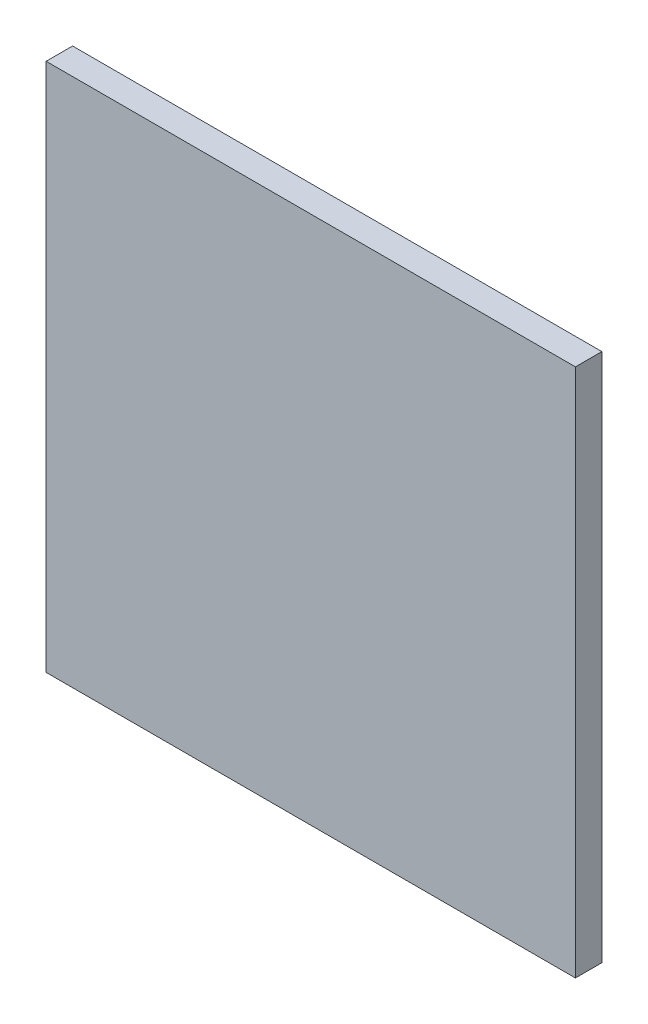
ISO-10303-21;
HEADER;
FILE_DESCRIPTION(('STEP AP214'),'2;1');
FILE_NAME('part.step','',(''),(''),'','','');
FILE_SCHEMA(('AUTOMOTIVE_DESIGN { 1 0 10303 214 1 1 1 1 }'));
ENDSEC;
DATA;
#1=APPLICATION_CONTEXT('core data for automotive mechanical design processes');
#2=APPLICATION_PROTOCOL_DEFINITION('international standard','automotive_design',2000,#1);
#3=PRODUCT_CONTEXT('',#1,'mechanical');
#4=PRODUCT('Part','Part','',(#3));
#5=PRODUCT_RELATED_PRODUCT_CATEGORY('part','',(#4));
#6=PRODUCT_DEFINITION_FORMATION('','',#4);
#7=PRODUCT_DEFINITION_CONTEXT('part definition',#1,'design');
#8=PRODUCT_DEFINITION('design','',#6,#7);
#9=PRODUCT_DEFINITION_SHAPE('','',#8);
#10=(LENGTH_UNIT() NAMED_UNIT(*) SI_UNIT(.MILLI.,.METRE.));
#11=(NAMED_UNIT(*) PLANE_ANGLE_UNIT() SI_UNIT($,.RADIAN.));
#12=(NAMED_UNIT(*) SI_UNIT($,.STERADIAN.) SOLID_ANGLE_UNIT());
#13=UNCERTAINTY_MEASURE_WITH_UNIT(LENGTH_MEASURE(1.E-05),#10,'distance_accuracy_value','');
#14=(GEOMETRIC_REPRESENTATION_CONTEXT(3) GLOBAL_UNCERTAINTY_ASSIGNED_CONTEXT((#13)) GLOBAL_UNIT_ASSIGNED_CONTEXT((#10,
#11,#12)) REPRESENTATION_CONTEXT('',''));
#15=CARTESIAN_POINT('',(0.,0.,0.));
#16=DIRECTION('',(0.,0.,1.));
#17=DIRECTION('',(1.,0.,0.));
#18=AXIS2_PLACEMENT_3D('',#15,#16,#17);
#19=CARTESIAN_POINT('',(-2.,2.,0.2));
#20=DIRECTION('',(1.,0.,0.));
#21=DIRECTION('',(0.,1.,0.));
#22=AXIS2_PLACEMENT_3D('',#19,#20,#21);
#23=PLANE('',#22);
#24=DIRECTION('',(0.,-1.,0.));
#25=VECTOR('',#24,1.);
#26=CARTESIAN_POINT('',(-2.,2.,0.));
#27=LINE('',#26,#25);
#28=CARTESIAN_POINT('',(-2.,2.,0.));
#29=VERTEX_POINT('',#28);
#30=CARTESIAN_POINT('',(-2.,-2.,0.));
#31=VERTEX_POINT('',#30);
#32=EDGE_CURVE('E98',#29,#31,#27,.T.);
#33=ORIENTED_EDGE('',*,*,#32,.T.);
#34=DIRECTION('',(0.,0.,-1.));
#35=VECTOR('',#34,1.);
#36=CARTESIAN_POINT('',(-2.,-2.,0.2));
#37=LINE('',#36,#35);
#38=CARTESIAN_POINT('',(-2.,-2.,0.2));
#39=VERTEX_POINT('',#38);
#40=EDGE_CURVE('E11',#39,#31,#37,.T.);
#41=ORIENTED_EDGE('',*,*,#40,.F.);
#42=DIRECTION('',(0.,-1.,0.));
#43=VECTOR('',#42,1.);
#44=CARTESIAN_POINT('',(-2.,2.,0.2));
#45=LINE('',#44,#43);
#46=CARTESIAN_POINT('',(-2.,2.,0.2));
#47=VERTEX_POINT('',#46);
#48=EDGE_CURVE('E86',#47,#39,#45,.T.);
#49=ORIENTED_EDGE('',*,*,#48,.F.);
#50=DIRECTION('',(0.,0.,-1.));
#51=VECTOR('',#50,1.);
#52=CARTESIAN_POINT('',(-2.,2.,0.2));
#53=LINE('',#52,#51);
#54=EDGE_CURVE('E94',#47,#29,#53,.T.);
#55=ORIENTED_EDGE('',*,*,#54,.T.);
#56=EDGE_LOOP('',(#33,#41,#49,#55));
#57=FACE_BOUND('',#56,.T.);
#58=ADVANCED_FACE('F35',(#57),#23,.F.);
#59=CARTESIAN_POINT('',(-2.,-2.,0.2));
#60=DIRECTION('',(0.,1.,0.));
#61=DIRECTION('',(0.,0.,1.));
#62=AXIS2_PLACEMENT_3D('',#59,#60,#61);
#63=PLANE('',#62);
#64=DIRECTION('',(1.,0.,0.));
#65=VECTOR('',#64,1.);
#66=CARTESIAN_POINT('',(-2.,-2.,0.));
#67=LINE('',#66,#65);
#68=CARTESIAN_POINT('',(2.,-2.,0.));
#69=VERTEX_POINT('',#68);
#70=EDGE_CURVE('E90',#31,#69,#67,.T.);
#71=ORIENTED_EDGE('',*,*,#70,.T.);
#72=DIRECTION('',(0.,0.,-1.));
#73=VECTOR('',#72,1.);
#74=CARTESIAN_POINT('',(2.,-2.,0.2));
#75=LINE('',#74,#73);
#76=CARTESIAN_POINT('',(2.,-2.,0.2));
#77=VERTEX_POINT('',#76);
#78=EDGE_CURVE('E43',#77,#69,#75,.T.);
#79=ORIENTED_EDGE('',*,*,#78,.F.);
#80=DIRECTION('',(1.,0.,0.));
#81=VECTOR('',#80,1.);
#82=CARTESIAN_POINT('',(-2.,-2.,0.2));
#83=LINE('',#82,#81);
#84=EDGE_CURVE('E81',#39,#77,#83,.T.);
#85=ORIENTED_EDGE('',*,*,#84,.F.);
#86=ORIENTED_EDGE('',*,*,#40,.T.);
#87=EDGE_LOOP('',(#71,#79,#85,#86));
#88=FACE_BOUND('',#87,.T.);
#89=ADVANCED_FACE('F89',(#88),#63,.F.);
#90=CARTESIAN_POINT('',(2.,2.,0.2));
#91=DIRECTION('',(-1.,0.,0.));
#92=DIRECTION('',(0.,-1.,0.));
#93=AXIS2_PLACEMENT_3D('',#90,#91,#92);
#94=PLANE('',#93);
#95=DIRECTION('',(0.,1.,0.));
#96=VECTOR('',#95,1.);
#97=CARTESIAN_POINT('',(2.,2.,0.));
#98=LINE('',#97,#96);
#99=CARTESIAN_POINT('',(2.,2.,0.));
#100=VERTEX_POINT('',#99);
#101=EDGE_CURVE('E68',#69,#100,#98,.T.);
#102=ORIENTED_EDGE('',*,*,#101,.T.);
#103=DIRECTION('',(0.,0.,-1.));
#104=VECTOR('',#103,1.);
#105=CARTESIAN_POINT('',(2.,2.,0.2));
#106=LINE('',#105,#104);
#107=CARTESIAN_POINT('',(2.,2.,0.2));
#108=VERTEX_POINT('',#107);
#109=EDGE_CURVE('E91',#108,#100,#106,.T.);
#110=ORIENTED_EDGE('',*,*,#109,.F.);
#111=DIRECTION('',(0.,1.,0.));
#112=VECTOR('',#111,1.);
#113=CARTESIAN_POINT('',(2.,2.,0.2));
#114=LINE('',#113,#112);
#115=EDGE_CURVE('E84',#77,#108,#114,.T.);
#116=ORIENTED_EDGE('',*,*,#115,.F.);
#117=ORIENTED_EDGE('',*,*,#78,.T.);
#118=EDGE_LOOP('',(#102,#110,#116,#117));
#119=FACE_BOUND('',#118,.T.);
#120=ADVANCED_FACE('F92',(#119),#94,.F.);
#121=CARTESIAN_POINT('',(-2.,2.,0.2));
#122=DIRECTION('',(0.,-1.,0.));
#123=DIRECTION('',(0.,0.,-1.));
#124=AXIS2_PLACEMENT_3D('',#121,#122,#123);
#125=PLANE('',#124);
#126=DIRECTION('',(-1.,0.,0.));
#127=VECTOR('',#126,1.);
#128=CARTESIAN_POINT('',(-2.,2.,0.));
#129=LINE('',#128,#127);
#130=EDGE_CURVE('E74',#100,#29,#129,.T.);
#131=ORIENTED_EDGE('',*,*,#130,.T.);
#132=ORIENTED_EDGE('',*,*,#54,.F.);
#133=DIRECTION('',(-1.,0.,0.));
#134=VECTOR('',#133,1.);
#135=CARTESIAN_POINT('',(-2.,2.,0.2));
#136=LINE('',#135,#134);
#137=EDGE_CURVE('E51',#108,#47,#136,.T.);
#138=ORIENTED_EDGE('',*,*,#137,.F.);
#139=ORIENTED_EDGE('',*,*,#109,.T.);
#140=EDGE_LOOP('',(#131,#132,#138,#139));
#141=FACE_BOUND('',#140,.T.);
#142=ADVANCED_FACE('F105',(#141),#125,.F.);
#143=CARTESIAN_POINT('',(-2.,-2.,0.2));
#144=DIRECTION('',(0.,0.,1.));
#145=DIRECTION('',(1.,0.,0.));
#146=AXIS2_PLACEMENT_3D('',#143,#144,#145);
#147=PLANE('',#146);
#148=ORIENTED_EDGE('',*,*,#48,.T.);
#149=ORIENTED_EDGE('',*,*,#84,.T.);
#150=ORIENTED_EDGE('',*,*,#115,.T.);
#151=ORIENTED_EDGE('',*,*,#137,.T.);
#152=EDGE_LOOP('',(#148,#149,#150,#151));
#153=FACE_BOUND('',#152,.T.);
#154=ADVANCED_FACE('F82',(#153),#147,.T.);
#155=CARTESIAN_POINT('',(-2.,-2.,0.));
#156=DIRECTION('',(0.,0.,1.));
#157=DIRECTION('',(1.,0.,0.));
#158=AXIS2_PLACEMENT_3D('',#155,#156,#157);
#159=PLANE('',#158);
#160=ORIENTED_EDGE('',*,*,#32,.F.);
#161=ORIENTED_EDGE('',*,*,#130,.F.);
#162=ORIENTED_EDGE('',*,*,#101,.F.);
#163=ORIENTED_EDGE('',*,*,#70,.F.);
#164=EDGE_LOOP('',(#160,#161,#162,#163));
#165=FACE_BOUND('',#164,.T.);
#166=ADVANCED_FACE('F108',(#165),#159,.F.);
#167=CLOSED_SHELL('',(#58,#89,#120,#142,#154,#166));
#168=MANIFOLD_SOLID_BREP('B2',#167);
#169=ADVANCED_BREP_SHAPE_REPRESENTATION('',(#18,#168),#14);
#170=SHAPE_DEFINITION_REPRESENTATION(#9,#169);
ENDSEC;
END-ISO-10303-21;
